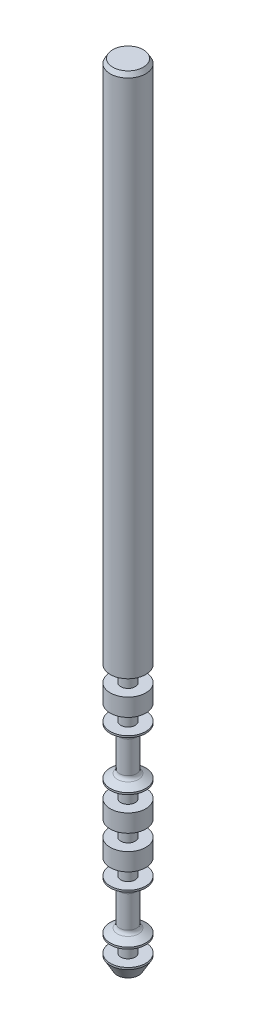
ISO-10303-21;
HEADER;
FILE_DESCRIPTION(('STEP AP214'),'2;1');
FILE_NAME('part.step','',(''),(''),'','','');
FILE_SCHEMA(('AUTOMOTIVE_DESIGN { 1 0 10303 214 1 1 1 1 }'));
ENDSEC;
DATA;
#1=APPLICATION_CONTEXT('core data for automotive mechanical design processes');
#2=APPLICATION_PROTOCOL_DEFINITION('international standard','automotive_design',2000,#1);
#3=PRODUCT_CONTEXT('',#1,'mechanical');
#4=PRODUCT('Part','Part','',(#3));
#5=PRODUCT_RELATED_PRODUCT_CATEGORY('part','',(#4));
#6=PRODUCT_DEFINITION_FORMATION('','',#4);
#7=PRODUCT_DEFINITION_CONTEXT('part definition',#1,'design');
#8=PRODUCT_DEFINITION('design','',#6,#7);
#9=PRODUCT_DEFINITION_SHAPE('','',#8);
#10=(LENGTH_UNIT() NAMED_UNIT(*) SI_UNIT(.MILLI.,.METRE.));
#11=(NAMED_UNIT(*) PLANE_ANGLE_UNIT() SI_UNIT($,.RADIAN.));
#12=(NAMED_UNIT(*) SI_UNIT($,.STERADIAN.) SOLID_ANGLE_UNIT());
#13=UNCERTAINTY_MEASURE_WITH_UNIT(LENGTH_MEASURE(1.E-05),#10,'distance_accuracy_value','');
#14=(GEOMETRIC_REPRESENTATION_CONTEXT(3) GLOBAL_UNCERTAINTY_ASSIGNED_CONTEXT((#13)) GLOBAL_UNIT_ASSIGNED_CONTEXT((#10,
#11,#12)) REPRESENTATION_CONTEXT('',''));
#15=CARTESIAN_POINT('',(0.,0.,0.));
#16=DIRECTION('',(0.,0.,1.));
#17=DIRECTION('',(1.,0.,0.));
#18=AXIS2_PLACEMENT_3D('',#15,#16,#17);
#19=CARTESIAN_POINT('',(58.02,-2.4,1.65));
#20=DIRECTION('',(0.,1.,0.));
#21=DIRECTION('',(0.,0.,1.));
#22=AXIS2_PLACEMENT_3D('',#19,#20,#21);
#23=PLANE('',#22);
#24=CARTESIAN_POINT('',(56.,-2.4,1.65));
#25=DIRECTION('',(0.,1.,0.));
#26=DIRECTION('',(0.,0.,1.));
#27=AXIS2_PLACEMENT_3D('',#24,#25,#26);
#28=CIRCLE('',#27,1.73132486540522);
#29=CARTESIAN_POINT('',(56.,-2.4,3.38132486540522));
#30=VERTEX_POINT('',#29);
#31=EDGE_CURVE('E12',#30,#30,#28,.T.);
#32=ORIENTED_EDGE('',*,*,#31,.T.);
#33=EDGE_LOOP('',(#32));
#34=FACE_BOUND('',#33,.T.);
#35=ADVANCED_FACE('F45',(#34),#23,.T.);
#36=CARTESIAN_POINT('',(56.,-1065.45754338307,1.65));
#37=DIRECTION('',(0.,-1.,0.));
#38=DIRECTION('',(0.,0.,-1.));
#39=AXIS2_PLACEMENT_3D('',#36,#37,#38);
#40=CYLINDRICAL_SURFACE('',#39,2.02);
#41=CARTESIAN_POINT('',(56.,-2.8999999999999,1.65));
#42=DIRECTION('',(0.,1.,0.));
#43=DIRECTION('',(0.,0.,1.));
#44=AXIS2_PLACEMENT_3D('',#41,#42,#43);
#45=CIRCLE('',#44,2.02);
#46=CARTESIAN_POINT('',(56.,-2.8999999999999,3.67));
#47=VERTEX_POINT('',#46);
#48=EDGE_CURVE('E52',#47,#47,#45,.F.);
#49=ORIENTED_EDGE('',*,*,#48,.T.);
#50=EDGE_LOOP('',(#49));
#51=FACE_BOUND('',#50,.T.);
#52=CARTESIAN_POINT('',(56.,-62.0000000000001,1.65));
#53=DIRECTION('',(0.,-1.,0.));
#54=DIRECTION('',(0.,0.,-1.));
#55=AXIS2_PLACEMENT_3D('',#52,#53,#54);
#56=CIRCLE('',#55,2.02000000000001);
#57=CARTESIAN_POINT('',(56.,-62.0000000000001,-0.370000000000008));
#58=VERTEX_POINT('',#57);
#59=EDGE_CURVE('E89',#58,#58,#56,.T.);
#60=ORIENTED_EDGE('',*,*,#59,.F.);
#61=EDGE_LOOP('',(#60));
#62=FACE_BOUND('',#61,.T.);
#63=ADVANCED_FACE('F192',(#51,#62),#40,.T.);
#64=CARTESIAN_POINT('',(56.82,-62.,1.65));
#65=DIRECTION('',(0.,-1.,0.));
#66=DIRECTION('',(0.,0.,-1.));
#67=AXIS2_PLACEMENT_3D('',#64,#65,#66);
#68=PLANE('',#67);
#69=ORIENTED_EDGE('',*,*,#59,.T.);
#70=EDGE_LOOP('',(#69));
#71=FACE_BOUND('',#70,.T.);
#72=CARTESIAN_POINT('',(56.,-62.0000000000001,1.65));
#73=DIRECTION('',(0.,-1.,0.));
#74=DIRECTION('',(0.,0.,-1.));
#75=AXIS2_PLACEMENT_3D('',#72,#73,#74);
#76=CIRCLE('',#75,0.820000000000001);
#77=CARTESIAN_POINT('',(56.,-62.0000000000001,0.829999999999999));
#78=VERTEX_POINT('',#77);
#79=EDGE_CURVE('E92',#78,#78,#76,.T.);
#80=ORIENTED_EDGE('',*,*,#79,.F.);
#81=EDGE_LOOP('',(#80));
#82=FACE_BOUND('',#81,.T.);
#83=ADVANCED_FACE('F198',(#71,#82),#68,.T.);
#84=CARTESIAN_POINT('',(56.,-1065.45754338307,1.65));
#85=DIRECTION('',(0.,-1.,0.));
#86=DIRECTION('',(0.,0.,-1.));
#87=AXIS2_PLACEMENT_3D('',#84,#85,#86);
#88=CYLINDRICAL_SURFACE('',#87,0.820000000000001);
#89=ORIENTED_EDGE('',*,*,#79,.T.);
#90=EDGE_LOOP('',(#89));
#91=FACE_BOUND('',#90,.T.);
#92=CARTESIAN_POINT('',(56.,-63.8000000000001,1.65));
#93=DIRECTION('',(0.,-1.,0.));
#94=DIRECTION('',(0.,0.,-1.));
#95=AXIS2_PLACEMENT_3D('',#92,#93,#94);
#96=CIRCLE('',#95,0.820000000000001);
#97=CARTESIAN_POINT('',(56.,-63.8000000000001,0.829999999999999));
#98=VERTEX_POINT('',#97);
#99=EDGE_CURVE('E95',#98,#98,#96,.T.);
#100=ORIENTED_EDGE('',*,*,#99,.F.);
#101=EDGE_LOOP('',(#100));
#102=FACE_BOUND('',#101,.T.);
#103=ADVANCED_FACE('F515',(#91,#102),#88,.T.);
#104=CARTESIAN_POINT('',(58.02,-63.8,1.65));
#105=DIRECTION('',(0.,1.,0.));
#106=DIRECTION('',(0.,0.,1.));
#107=AXIS2_PLACEMENT_3D('',#104,#105,#106);
#108=PLANE('',#107);
#109=ORIENTED_EDGE('',*,*,#99,.T.);
#110=EDGE_LOOP('',(#109));
#111=FACE_BOUND('',#110,.T.);
#112=CARTESIAN_POINT('',(56.,-63.8000000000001,1.65));
#113=DIRECTION('',(0.,-1.,0.));
#114=DIRECTION('',(0.,0.,-1.));
#115=AXIS2_PLACEMENT_3D('',#112,#113,#114);
#116=CIRCLE('',#115,2.02);
#117=CARTESIAN_POINT('',(56.,-63.8000000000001,-0.370000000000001));
#118=VERTEX_POINT('',#117);
#119=EDGE_CURVE('E98',#118,#118,#116,.T.);
#120=ORIENTED_EDGE('',*,*,#119,.F.);
#121=EDGE_LOOP('',(#120));
#122=FACE_BOUND('',#121,.T.);
#123=ADVANCED_FACE('F506',(#111,#122),#108,.T.);
#124=CARTESIAN_POINT('',(56.,-1065.45754338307,1.65));
#125=DIRECTION('',(0.,-1.,0.));
#126=DIRECTION('',(0.,0.,-1.));
#127=AXIS2_PLACEMENT_3D('',#124,#125,#126);
#128=CYLINDRICAL_SURFACE('',#127,2.02);
#129=ORIENTED_EDGE('',*,*,#119,.T.);
#130=EDGE_LOOP('',(#129));
#131=FACE_BOUND('',#130,.T.);
#132=CARTESIAN_POINT('',(56.,-65.8,1.65));
#133=DIRECTION('',(0.,-1.,0.));
#134=DIRECTION('',(0.,0.,-1.));
#135=AXIS2_PLACEMENT_3D('',#132,#133,#134);
#136=CIRCLE('',#135,2.02);
#137=CARTESIAN_POINT('',(56.,-65.8,-0.370000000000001));
#138=VERTEX_POINT('',#137);
#139=EDGE_CURVE('E101',#138,#138,#136,.T.);
#140=ORIENTED_EDGE('',*,*,#139,.F.);
#141=EDGE_LOOP('',(#140));
#142=FACE_BOUND('',#141,.T.);
#143=ADVANCED_FACE('F497',(#131,#142),#128,.T.);
#144=CARTESIAN_POINT('',(58.02,-65.8,1.65));
#145=DIRECTION('',(0.,-1.,0.));
#146=DIRECTION('',(0.,0.,-1.));
#147=AXIS2_PLACEMENT_3D('',#144,#145,#146);
#148=PLANE('',#147);
#149=ORIENTED_EDGE('',*,*,#139,.T.);
#150=EDGE_LOOP('',(#149));
#151=FACE_BOUND('',#150,.T.);
#152=CARTESIAN_POINT('',(56.,-65.8,1.65));
#153=DIRECTION('',(0.,-1.,0.));
#154=DIRECTION('',(0.,0.,-1.));
#155=AXIS2_PLACEMENT_3D('',#152,#153,#154);
#156=CIRCLE('',#155,0.820000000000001);
#157=CARTESIAN_POINT('',(56.,-65.8,0.829999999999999));
#158=VERTEX_POINT('',#157);
#159=EDGE_CURVE('E104',#158,#158,#156,.T.);
#160=ORIENTED_EDGE('',*,*,#159,.F.);
#161=EDGE_LOOP('',(#160));
#162=FACE_BOUND('',#161,.T.);
#163=ADVANCED_FACE('F488',(#151,#162),#148,.T.);
#164=CARTESIAN_POINT('',(56.,-1065.45754338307,1.65));
#165=DIRECTION('',(0.,-1.,0.));
#166=DIRECTION('',(0.,0.,-1.));
#167=AXIS2_PLACEMENT_3D('',#164,#165,#166);
#168=CYLINDRICAL_SURFACE('',#167,0.820000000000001);
#169=ORIENTED_EDGE('',*,*,#159,.T.);
#170=EDGE_LOOP('',(#169));
#171=FACE_BOUND('',#170,.T.);
#172=CARTESIAN_POINT('',(56.,-67.6,1.65));
#173=DIRECTION('',(0.,-1.,0.));
#174=DIRECTION('',(0.,0.,-1.));
#175=AXIS2_PLACEMENT_3D('',#172,#173,#174);
#176=CIRCLE('',#175,0.820000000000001);
#177=CARTESIAN_POINT('',(56.,-67.6,0.829999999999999));
#178=VERTEX_POINT('',#177);
#179=EDGE_CURVE('E107',#178,#178,#176,.T.);
#180=ORIENTED_EDGE('',*,*,#179,.F.);
#181=EDGE_LOOP('',(#180));
#182=FACE_BOUND('',#181,.T.);
#183=ADVANCED_FACE('F479',(#171,#182),#168,.T.);
#184=CARTESIAN_POINT('',(56.82,-67.6,1.65));
#185=DIRECTION('',(0.,1.,0.));
#186=DIRECTION('',(0.,0.,1.));
#187=AXIS2_PLACEMENT_3D('',#184,#185,#186);
#188=PLANE('',#187);
#189=ORIENTED_EDGE('',*,*,#179,.T.);
#190=EDGE_LOOP('',(#189));
#191=FACE_BOUND('',#190,.T.);
#192=CARTESIAN_POINT('',(56.,-67.6,1.65));
#193=DIRECTION('',(0.,-1.,0.));
#194=DIRECTION('',(0.,0.,-1.));
#195=AXIS2_PLACEMENT_3D('',#192,#193,#194);
#196=CIRCLE('',#195,2.02);
#197=CARTESIAN_POINT('',(56.,-67.6,-0.370000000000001));
#198=VERTEX_POINT('',#197);
#199=EDGE_CURVE('E110',#198,#198,#196,.T.);
#200=ORIENTED_EDGE('',*,*,#199,.F.);
#201=EDGE_LOOP('',(#200));
#202=FACE_BOUND('',#201,.T.);
#203=ADVANCED_FACE('F470',(#191,#202),#188,.T.);
#204=CARTESIAN_POINT('',(56.,-1065.45754338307,1.65));
#205=DIRECTION('',(0.,-1.,0.));
#206=DIRECTION('',(0.,0.,-1.));
#207=AXIS2_PLACEMENT_3D('',#204,#205,#206);
#208=CYLINDRICAL_SURFACE('',#207,2.02);
#209=ORIENTED_EDGE('',*,*,#199,.T.);
#210=EDGE_LOOP('',(#209));
#211=FACE_BOUND('',#210,.T.);
#212=CARTESIAN_POINT('',(56.,-67.8,1.65));
#213=DIRECTION('',(0.,-1.,0.));
#214=DIRECTION('',(0.,0.,-1.));
#215=AXIS2_PLACEMENT_3D('',#212,#213,#214);
#216=CIRCLE('',#215,2.02);
#217=CARTESIAN_POINT('',(56.,-67.8,-0.370000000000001));
#218=VERTEX_POINT('',#217);
#219=EDGE_CURVE('E113',#218,#218,#216,.T.);
#220=ORIENTED_EDGE('',*,*,#219,.F.);
#221=EDGE_LOOP('',(#220));
#222=FACE_BOUND('',#221,.T.);
#223=ADVANCED_FACE('F462',(#211,#222),#208,.T.);
#224=CARTESIAN_POINT('',(56.,-68.4177647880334,1.65));
#225=DIRECTION('',(0.,1.,0.));
#226=DIRECTION('',(0.,0.,1.));
#227=AXIS2_PLACEMENT_3D('',#224,#225,#226);
#228=CONICAL_SURFACE('',#227,0.95,1.04719755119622);
#229=CARTESIAN_POINT('',(56.,-68.273427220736,1.65));
#230=DIRECTION('',(0.,1.,0.));
#231=DIRECTION('',(0.,0.,1.));
#232=AXIS2_PLACEMENT_3D('',#229,#230,#231);
#233=CIRCLE('',#232,1.19999999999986);
#234=CARTESIAN_POINT('',(56.,-68.273427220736,2.84999999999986));
#235=VERTEX_POINT('',#234);
#236=EDGE_CURVE('E65',#235,#235,#233,.T.);
#237=ORIENTED_EDGE('',*,*,#236,.T.);
#238=EDGE_LOOP('',(#237));
#239=FACE_BOUND('',#238,.T.);
#240=ORIENTED_EDGE('',*,*,#219,.T.);
#241=EDGE_LOOP('',(#240));
#242=FACE_BOUND('',#241,.T.);
#243=ADVANCED_FACE('F454',(#239,#242),#228,.T.);
#244=CARTESIAN_POINT('',(56.,-1065.45754338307,1.65));
#245=DIRECTION('',(0.,-1.,0.));
#246=DIRECTION('',(0.,0.,-1.));
#247=AXIS2_PLACEMENT_3D('',#244,#245,#246);
#248=CYLINDRICAL_SURFACE('',#247,0.95);
#249=CARTESIAN_POINT('',(56.,-72.2935600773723,1.65));
#250=DIRECTION('',(0.,-1.,0.));
#251=DIRECTION('',(0.,0.,-1.));
#252=AXIS2_PLACEMENT_3D('',#249,#250,#251);
#253=CIRCLE('',#252,0.95);
#254=CARTESIAN_POINT('',(56.,-72.2935600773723,0.700000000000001));
#255=VERTEX_POINT('',#254);
#256=EDGE_CURVE('E68',#255,#255,#253,.F.);
#257=ORIENTED_EDGE('',*,*,#256,.T.);
#258=EDGE_LOOP('',(#257));
#259=FACE_BOUND('',#258,.T.);
#260=CARTESIAN_POINT('',(56.,-68.706439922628,1.65));
#261=DIRECTION('',(0.,-1.,0.));
#262=DIRECTION('',(0.,0.,-1.));
#263=AXIS2_PLACEMENT_3D('',#260,#261,#262);
#264=CIRCLE('',#263,0.95);
#265=CARTESIAN_POINT('',(56.,-68.706439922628,0.700000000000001));
#266=VERTEX_POINT('',#265);
#267=EDGE_CURVE('E71',#266,#266,#264,.T.);
#268=ORIENTED_EDGE('',*,*,#267,.T.);
#269=EDGE_LOOP('',(#268));
#270=FACE_BOUND('',#269,.T.);
#271=ADVANCED_FACE('F445',(#259,#270),#248,.T.);
#272=CARTESIAN_POINT('',(56.,-73.2,1.65));
#273=DIRECTION('',(0.,-1.,0.));
#274=DIRECTION('',(0.,0.,-1.));
#275=AXIS2_PLACEMENT_3D('',#272,#273,#274);
#276=CONICAL_SURFACE('',#275,2.02,1.04719755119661);
#277=CARTESIAN_POINT('',(56.,-72.7265727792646,1.65));
#278=DIRECTION('',(0.,-1.,0.));
#279=DIRECTION('',(0.,0.,-1.));
#280=AXIS2_PLACEMENT_3D('',#277,#278,#279);
#281=CIRCLE('',#280,1.19999999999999);
#282=CARTESIAN_POINT('',(56.,-72.7265727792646,0.450000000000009));
#283=VERTEX_POINT('',#282);
#284=EDGE_CURVE('E74',#283,#283,#281,.T.);
#285=ORIENTED_EDGE('',*,*,#284,.T.);
#286=EDGE_LOOP('',(#285));
#287=FACE_BOUND('',#286,.T.);
#288=CARTESIAN_POINT('',(56.,-73.2,1.65));
#289=DIRECTION('',(0.,-1.,0.));
#290=DIRECTION('',(0.,0.,-1.));
#291=AXIS2_PLACEMENT_3D('',#288,#289,#290);
#292=CIRCLE('',#291,2.02);
#293=CARTESIAN_POINT('',(56.,-73.2,-0.370000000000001));
#294=VERTEX_POINT('',#293);
#295=EDGE_CURVE('E116',#294,#294,#292,.T.);
#296=ORIENTED_EDGE('',*,*,#295,.F.);
#297=EDGE_LOOP('',(#296));
#298=FACE_BOUND('',#297,.T.);
#299=ADVANCED_FACE('F436',(#287,#298),#276,.T.);
#300=CARTESIAN_POINT('',(56.,-1065.45754338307,1.65));
#301=DIRECTION('',(0.,-1.,0.));
#302=DIRECTION('',(0.,0.,-1.));
#303=AXIS2_PLACEMENT_3D('',#300,#301,#302);
#304=CYLINDRICAL_SURFACE('',#303,2.02);
#305=ORIENTED_EDGE('',*,*,#295,.T.);
#306=EDGE_LOOP('',(#305));
#307=FACE_BOUND('',#306,.T.);
#308=CARTESIAN_POINT('',(56.,-73.4,1.65));
#309=DIRECTION('',(0.,-1.,0.));
#310=DIRECTION('',(0.,0.,-1.));
#311=AXIS2_PLACEMENT_3D('',#308,#309,#310);
#312=CIRCLE('',#311,2.02);
#313=CARTESIAN_POINT('',(56.,-73.4,-0.370000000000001));
#314=VERTEX_POINT('',#313);
#315=EDGE_CURVE('E119',#314,#314,#312,.T.);
#316=ORIENTED_EDGE('',*,*,#315,.F.);
#317=EDGE_LOOP('',(#316));
#318=FACE_BOUND('',#317,.T.);
#319=ADVANCED_FACE('F427',(#307,#318),#304,.T.);
#320=CARTESIAN_POINT('',(58.02,-73.4,1.65));
#321=DIRECTION('',(0.,-1.,0.));
#322=DIRECTION('',(0.,0.,-1.));
#323=AXIS2_PLACEMENT_3D('',#320,#321,#322);
#324=PLANE('',#323);
#325=ORIENTED_EDGE('',*,*,#315,.T.);
#326=EDGE_LOOP('',(#325));
#327=FACE_BOUND('',#326,.T.);
#328=CARTESIAN_POINT('',(56.,-73.4,1.65));
#329=DIRECTION('',(0.,-1.,0.));
#330=DIRECTION('',(0.,0.,-1.));
#331=AXIS2_PLACEMENT_3D('',#328,#329,#330);
#332=CIRCLE('',#331,0.820000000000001);
#333=CARTESIAN_POINT('',(56.,-73.4,0.829999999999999));
#334=VERTEX_POINT('',#333);
#335=EDGE_CURVE('E122',#334,#334,#332,.T.);
#336=ORIENTED_EDGE('',*,*,#335,.F.);
#337=EDGE_LOOP('',(#336));
#338=FACE_BOUND('',#337,.T.);
#339=ADVANCED_FACE('F418',(#327,#338),#324,.T.);
#340=CARTESIAN_POINT('',(56.,-1065.45754338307,1.65));
#341=DIRECTION('',(0.,-1.,0.));
#342=DIRECTION('',(0.,0.,-1.));
#343=AXIS2_PLACEMENT_3D('',#340,#341,#342);
#344=CYLINDRICAL_SURFACE('',#343,0.820000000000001);
#345=ORIENTED_EDGE('',*,*,#335,.T.);
#346=EDGE_LOOP('',(#345));
#347=FACE_BOUND('',#346,.T.);
#348=CARTESIAN_POINT('',(56.,-75.2,1.65));
#349=DIRECTION('',(0.,-1.,0.));
#350=DIRECTION('',(0.,0.,-1.));
#351=AXIS2_PLACEMENT_3D('',#348,#349,#350);
#352=CIRCLE('',#351,0.820000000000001);
#353=CARTESIAN_POINT('',(56.,-75.2,0.829999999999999));
#354=VERTEX_POINT('',#353);
#355=EDGE_CURVE('E125',#354,#354,#352,.T.);
#356=ORIENTED_EDGE('',*,*,#355,.F.);
#357=EDGE_LOOP('',(#356));
#358=FACE_BOUND('',#357,.T.);
#359=ADVANCED_FACE('F409',(#347,#358),#344,.T.);
#360=CARTESIAN_POINT('',(56.82,-75.2,1.65));
#361=DIRECTION('',(0.,1.,0.));
#362=DIRECTION('',(0.,0.,1.));
#363=AXIS2_PLACEMENT_3D('',#360,#361,#362);
#364=PLANE('',#363);
#365=ORIENTED_EDGE('',*,*,#355,.T.);
#366=EDGE_LOOP('',(#365));
#367=FACE_BOUND('',#366,.T.);
#368=CARTESIAN_POINT('',(56.,-75.2,1.65));
#369=DIRECTION('',(0.,-1.,0.));
#370=DIRECTION('',(0.,0.,-1.));
#371=AXIS2_PLACEMENT_3D('',#368,#369,#370);
#372=CIRCLE('',#371,2.02);
#373=CARTESIAN_POINT('',(56.,-75.2,-0.370000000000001));
#374=VERTEX_POINT('',#373);
#375=EDGE_CURVE('E128',#374,#374,#372,.T.);
#376=ORIENTED_EDGE('',*,*,#375,.F.);
#377=EDGE_LOOP('',(#376));
#378=FACE_BOUND('',#377,.T.);
#379=ADVANCED_FACE('F400',(#367,#378),#364,.T.);
#380=CARTESIAN_POINT('',(56.,-1065.45754338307,1.65));
#381=DIRECTION('',(0.,-1.,0.));
#382=DIRECTION('',(0.,0.,-1.));
#383=AXIS2_PLACEMENT_3D('',#380,#381,#382);
#384=CYLINDRICAL_SURFACE('',#383,2.02);
#385=ORIENTED_EDGE('',*,*,#375,.T.);
#386=EDGE_LOOP('',(#385));
#387=FACE_BOUND('',#386,.T.);
#388=CARTESIAN_POINT('',(56.,-77.2,1.65));
#389=DIRECTION('',(0.,-1.,0.));
#390=DIRECTION('',(0.,0.,-1.));
#391=AXIS2_PLACEMENT_3D('',#388,#389,#390);
#392=CIRCLE('',#391,2.02);
#393=CARTESIAN_POINT('',(56.,-77.2,-0.370000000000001));
#394=VERTEX_POINT('',#393);
#395=EDGE_CURVE('E131',#394,#394,#392,.T.);
#396=ORIENTED_EDGE('',*,*,#395,.F.);
#397=EDGE_LOOP('',(#396));
#398=FACE_BOUND('',#397,.T.);
#399=ADVANCED_FACE('F391',(#387,#398),#384,.T.);
#400=CARTESIAN_POINT('',(58.02,-77.2,1.65));
#401=DIRECTION('',(0.,-1.,0.));
#402=DIRECTION('',(0.,0.,-1.));
#403=AXIS2_PLACEMENT_3D('',#400,#401,#402);
#404=PLANE('',#403);
#405=ORIENTED_EDGE('',*,*,#395,.T.);
#406=EDGE_LOOP('',(#405));
#407=FACE_BOUND('',#406,.T.);
#408=CARTESIAN_POINT('',(56.,-77.2,1.65));
#409=DIRECTION('',(0.,-1.,0.));
#410=DIRECTION('',(0.,0.,-1.));
#411=AXIS2_PLACEMENT_3D('',#408,#409,#410);
#412=CIRCLE('',#411,0.820000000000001);
#413=CARTESIAN_POINT('',(56.,-77.2,0.829999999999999));
#414=VERTEX_POINT('',#413);
#415=EDGE_CURVE('E134',#414,#414,#412,.T.);
#416=ORIENTED_EDGE('',*,*,#415,.F.);
#417=EDGE_LOOP('',(#416));
#418=FACE_BOUND('',#417,.T.);
#419=ADVANCED_FACE('F382',(#407,#418),#404,.T.);
#420=CARTESIAN_POINT('',(56.,-1065.45754338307,1.65));
#421=DIRECTION('',(0.,-1.,0.));
#422=DIRECTION('',(0.,0.,-1.));
#423=AXIS2_PLACEMENT_3D('',#420,#421,#422);
#424=CYLINDRICAL_SURFACE('',#423,0.820000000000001);
#425=ORIENTED_EDGE('',*,*,#415,.T.);
#426=EDGE_LOOP('',(#425));
#427=FACE_BOUND('',#426,.T.);
#428=CARTESIAN_POINT('',(56.,-79.,1.65));
#429=DIRECTION('',(0.,-1.,0.));
#430=DIRECTION('',(0.,0.,-1.));
#431=AXIS2_PLACEMENT_3D('',#428,#429,#430);
#432=CIRCLE('',#431,0.820000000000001);
#433=CARTESIAN_POINT('',(56.,-79.,0.829999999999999));
#434=VERTEX_POINT('',#433);
#435=EDGE_CURVE('E137',#434,#434,#432,.T.);
#436=ORIENTED_EDGE('',*,*,#435,.F.);
#437=EDGE_LOOP('',(#436));
#438=FACE_BOUND('',#437,.T.);
#439=ADVANCED_FACE('F373',(#427,#438),#424,.T.);
#440=CARTESIAN_POINT('',(56.82,-79.,1.65));
#441=DIRECTION('',(0.,1.,0.));
#442=DIRECTION('',(0.,0.,1.));
#443=AXIS2_PLACEMENT_3D('',#440,#441,#442);
#444=PLANE('',#443);
#445=ORIENTED_EDGE('',*,*,#435,.T.);
#446=EDGE_LOOP('',(#445));
#447=FACE_BOUND('',#446,.T.);
#448=CARTESIAN_POINT('',(56.,-79.,1.65));
#449=DIRECTION('',(0.,-1.,0.));
#450=DIRECTION('',(0.,0.,-1.));
#451=AXIS2_PLACEMENT_3D('',#448,#449,#450);
#452=CIRCLE('',#451,2.02);
#453=CARTESIAN_POINT('',(56.,-79.,-0.370000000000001));
#454=VERTEX_POINT('',#453);
#455=EDGE_CURVE('E140',#454,#454,#452,.T.);
#456=ORIENTED_EDGE('',*,*,#455,.F.);
#457=EDGE_LOOP('',(#456));
#458=FACE_BOUND('',#457,.T.);
#459=ADVANCED_FACE('F364',(#447,#458),#444,.T.);
#460=CARTESIAN_POINT('',(56.,-1065.45754338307,1.65));
#461=DIRECTION('',(0.,-1.,0.));
#462=DIRECTION('',(0.,0.,-1.));
#463=AXIS2_PLACEMENT_3D('',#460,#461,#462);
#464=CYLINDRICAL_SURFACE('',#463,2.02);
#465=ORIENTED_EDGE('',*,*,#455,.T.);
#466=EDGE_LOOP('',(#465));
#467=FACE_BOUND('',#466,.T.);
#468=CARTESIAN_POINT('',(56.,-81.,1.65));
#469=DIRECTION('',(0.,-1.,0.));
#470=DIRECTION('',(0.,0.,-1.));
#471=AXIS2_PLACEMENT_3D('',#468,#469,#470);
#472=CIRCLE('',#471,2.02);
#473=CARTESIAN_POINT('',(56.,-81.,-0.370000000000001));
#474=VERTEX_POINT('',#473);
#475=EDGE_CURVE('E143',#474,#474,#472,.T.);
#476=ORIENTED_EDGE('',*,*,#475,.F.);
#477=EDGE_LOOP('',(#476));
#478=FACE_BOUND('',#477,.T.);
#479=ADVANCED_FACE('F355',(#467,#478),#464,.T.);
#480=CARTESIAN_POINT('',(58.02,-81.,1.65));
#481=DIRECTION('',(0.,-1.,0.));
#482=DIRECTION('',(0.,0.,-1.));
#483=AXIS2_PLACEMENT_3D('',#480,#481,#482);
#484=PLANE('',#483);
#485=ORIENTED_EDGE('',*,*,#475,.T.);
#486=EDGE_LOOP('',(#485));
#487=FACE_BOUND('',#486,.T.);
#488=CARTESIAN_POINT('',(56.,-81.,1.65));
#489=DIRECTION('',(0.,-1.,0.));
#490=DIRECTION('',(0.,0.,-1.));
#491=AXIS2_PLACEMENT_3D('',#488,#489,#490);
#492=CIRCLE('',#491,0.820000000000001);
#493=CARTESIAN_POINT('',(56.,-81.,0.829999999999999));
#494=VERTEX_POINT('',#493);
#495=EDGE_CURVE('E146',#494,#494,#492,.T.);
#496=ORIENTED_EDGE('',*,*,#495,.F.);
#497=EDGE_LOOP('',(#496));
#498=FACE_BOUND('',#497,.T.);
#499=ADVANCED_FACE('F346',(#487,#498),#484,.T.);
#500=CARTESIAN_POINT('',(56.,-1065.45754338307,1.65));
#501=DIRECTION('',(0.,-1.,0.));
#502=DIRECTION('',(0.,0.,-1.));
#503=AXIS2_PLACEMENT_3D('',#500,#501,#502);
#504=CYLINDRICAL_SURFACE('',#503,0.820000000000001);
#505=ORIENTED_EDGE('',*,*,#495,.T.);
#506=EDGE_LOOP('',(#505));
#507=FACE_BOUND('',#506,.T.);
#508=CARTESIAN_POINT('',(56.,-82.8,1.65));
#509=DIRECTION('',(0.,-1.,0.));
#510=DIRECTION('',(0.,0.,-1.));
#511=AXIS2_PLACEMENT_3D('',#508,#509,#510);
#512=CIRCLE('',#511,0.820000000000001);
#513=CARTESIAN_POINT('',(56.,-82.8,0.829999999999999));
#514=VERTEX_POINT('',#513);
#515=EDGE_CURVE('E149',#514,#514,#512,.T.);
#516=ORIENTED_EDGE('',*,*,#515,.F.);
#517=EDGE_LOOP('',(#516));
#518=FACE_BOUND('',#517,.T.);
#519=ADVANCED_FACE('F337',(#507,#518),#504,.T.);
#520=CARTESIAN_POINT('',(56.82,-82.8,1.65));
#521=DIRECTION('',(0.,1.,0.));
#522=DIRECTION('',(0.,0.,1.));
#523=AXIS2_PLACEMENT_3D('',#520,#521,#522);
#524=PLANE('',#523);
#525=ORIENTED_EDGE('',*,*,#515,.T.);
#526=EDGE_LOOP('',(#525));
#527=FACE_BOUND('',#526,.T.);
#528=CARTESIAN_POINT('',(56.,-82.8,1.65));
#529=DIRECTION('',(0.,-1.,0.));
#530=DIRECTION('',(0.,0.,-1.));
#531=AXIS2_PLACEMENT_3D('',#528,#529,#530);
#532=CIRCLE('',#531,2.02000000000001);
#533=CARTESIAN_POINT('',(56.,-82.8,-0.370000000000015));
#534=VERTEX_POINT('',#533);
#535=EDGE_CURVE('E152',#534,#534,#532,.T.);
#536=ORIENTED_EDGE('',*,*,#535,.F.);
#537=EDGE_LOOP('',(#536));
#538=FACE_BOUND('',#537,.T.);
#539=ADVANCED_FACE('F328',(#527,#538),#524,.T.);
#540=CARTESIAN_POINT('',(56.,-1065.45754338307,1.65));
#541=DIRECTION('',(0.,-1.,0.));
#542=DIRECTION('',(0.,0.,-1.));
#543=AXIS2_PLACEMENT_3D('',#540,#541,#542);
#544=CYLINDRICAL_SURFACE('',#543,2.02000000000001);
#545=ORIENTED_EDGE('',*,*,#535,.T.);
#546=EDGE_LOOP('',(#545));
#547=FACE_BOUND('',#546,.T.);
#548=CARTESIAN_POINT('',(56.,-83.,1.65));
#549=DIRECTION('',(0.,-1.,0.));
#550=DIRECTION('',(0.,0.,-1.));
#551=AXIS2_PLACEMENT_3D('',#548,#549,#550);
#552=CIRCLE('',#551,2.02000000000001);
#553=CARTESIAN_POINT('',(56.,-83.,-0.370000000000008));
#554=VERTEX_POINT('',#553);
#555=EDGE_CURVE('E155',#554,#554,#552,.T.);
#556=ORIENTED_EDGE('',*,*,#555,.F.);
#557=EDGE_LOOP('',(#556));
#558=FACE_BOUND('',#557,.T.);
#559=ADVANCED_FACE('F319',(#547,#558),#544,.T.);
#560=CARTESIAN_POINT('',(56.,-83.617764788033,1.65));
#561=DIRECTION('',(0.,1.,0.));
#562=DIRECTION('',(0.,0.,1.));
#563=AXIS2_PLACEMENT_3D('',#560,#561,#562);
#564=CONICAL_SURFACE('',#563,0.95,1.04719755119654);
#565=CARTESIAN_POINT('',(56.,-83.4734272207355,1.65));
#566=DIRECTION('',(0.,1.,0.));
#567=DIRECTION('',(0.,0.,1.));
#568=AXIS2_PLACEMENT_3D('',#565,#566,#567);
#569=CIRCLE('',#568,1.19999999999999);
#570=CARTESIAN_POINT('',(56.,-83.4734272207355,2.84999999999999));
#571=VERTEX_POINT('',#570);
#572=EDGE_CURVE('E77',#571,#571,#569,.T.);
#573=ORIENTED_EDGE('',*,*,#572,.T.);
#574=EDGE_LOOP('',(#573));
#575=FACE_BOUND('',#574,.T.);
#576=ORIENTED_EDGE('',*,*,#555,.T.);
#577=EDGE_LOOP('',(#576));
#578=FACE_BOUND('',#577,.T.);
#579=ADVANCED_FACE('F310',(#575,#578),#564,.T.);
#580=CARTESIAN_POINT('',(56.,-1065.45754338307,1.65));
#581=DIRECTION('',(0.,-1.,0.));
#582=DIRECTION('',(0.,0.,-1.));
#583=AXIS2_PLACEMENT_3D('',#580,#581,#582);
#584=CYLINDRICAL_SURFACE('',#583,0.95);
#585=CARTESIAN_POINT('',(56.,-87.4935600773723,1.65));
#586=DIRECTION('',(0.,-1.,0.));
#587=DIRECTION('',(0.,0.,-1.));
#588=AXIS2_PLACEMENT_3D('',#585,#586,#587);
#589=CIRCLE('',#588,0.95);
#590=CARTESIAN_POINT('',(56.,-87.4935600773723,0.700000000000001));
#591=VERTEX_POINT('',#590);
#592=EDGE_CURVE('E80',#591,#591,#589,.F.);
#593=ORIENTED_EDGE('',*,*,#592,.T.);
#594=EDGE_LOOP('',(#593));
#595=FACE_BOUND('',#594,.T.);
#596=CARTESIAN_POINT('',(56.,-83.9064399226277,1.65));
#597=DIRECTION('',(0.,-1.,0.));
#598=DIRECTION('',(0.,0.,-1.));
#599=AXIS2_PLACEMENT_3D('',#596,#597,#598);
#600=CIRCLE('',#599,0.95);
#601=CARTESIAN_POINT('',(56.,-83.9064399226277,0.700000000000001));
#602=VERTEX_POINT('',#601);
#603=EDGE_CURVE('E83',#602,#602,#600,.T.);
#604=ORIENTED_EDGE('',*,*,#603,.T.);
#605=EDGE_LOOP('',(#604));
#606=FACE_BOUND('',#605,.T.);
#607=ADVANCED_FACE('F301',(#595,#606),#584,.T.);
#608=CARTESIAN_POINT('',(56.,-88.4,1.65));
#609=DIRECTION('',(0.,-1.,0.));
#610=DIRECTION('',(0.,0.,-1.));
#611=AXIS2_PLACEMENT_3D('',#608,#609,#610);
#612=CONICAL_SURFACE('',#611,2.02,1.04719755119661);
#613=CARTESIAN_POINT('',(56.,-87.9265727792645,1.65));
#614=DIRECTION('',(0.,-1.,0.));
#615=DIRECTION('',(0.,0.,-1.));
#616=AXIS2_PLACEMENT_3D('',#613,#614,#615);
#617=CIRCLE('',#616,1.19999999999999);
#618=CARTESIAN_POINT('',(56.,-87.9265727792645,0.450000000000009));
#619=VERTEX_POINT('',#618);
#620=EDGE_CURVE('E86',#619,#619,#617,.T.);
#621=ORIENTED_EDGE('',*,*,#620,.T.);
#622=EDGE_LOOP('',(#621));
#623=FACE_BOUND('',#622,.T.);
#624=CARTESIAN_POINT('',(56.,-88.4,1.65));
#625=DIRECTION('',(0.,-1.,0.));
#626=DIRECTION('',(0.,0.,-1.));
#627=AXIS2_PLACEMENT_3D('',#624,#625,#626);
#628=CIRCLE('',#627,2.02);
#629=CARTESIAN_POINT('',(56.,-88.4,-0.370000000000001));
#630=VERTEX_POINT('',#629);
#631=EDGE_CURVE('E158',#630,#630,#628,.T.);
#632=ORIENTED_EDGE('',*,*,#631,.F.);
#633=EDGE_LOOP('',(#632));
#634=FACE_BOUND('',#633,.T.);
#635=ADVANCED_FACE('F292',(#623,#634),#612,.T.);
#636=CARTESIAN_POINT('',(56.,-1065.45754338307,1.65));
#637=DIRECTION('',(0.,-1.,0.));
#638=DIRECTION('',(0.,0.,-1.));
#639=AXIS2_PLACEMENT_3D('',#636,#637,#638);
#640=CYLINDRICAL_SURFACE('',#639,2.02);
#641=ORIENTED_EDGE('',*,*,#631,.T.);
#642=EDGE_LOOP('',(#641));
#643=FACE_BOUND('',#642,.T.);
#644=CARTESIAN_POINT('',(56.,-88.6,1.65));
#645=DIRECTION('',(0.,-1.,0.));
#646=DIRECTION('',(0.,0.,-1.));
#647=AXIS2_PLACEMENT_3D('',#644,#645,#646);
#648=CIRCLE('',#647,2.02);
#649=CARTESIAN_POINT('',(56.,-88.6,-0.370000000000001));
#650=VERTEX_POINT('',#649);
#651=EDGE_CURVE('E161',#650,#650,#648,.T.);
#652=ORIENTED_EDGE('',*,*,#651,.F.);
#653=EDGE_LOOP('',(#652));
#654=FACE_BOUND('',#653,.T.);
#655=ADVANCED_FACE('F283',(#643,#654),#640,.T.);
#656=CARTESIAN_POINT('',(58.02,-88.6,1.65));
#657=DIRECTION('',(0.,-1.,0.));
#658=DIRECTION('',(0.,0.,-1.));
#659=AXIS2_PLACEMENT_3D('',#656,#657,#658);
#660=PLANE('',#659);
#661=ORIENTED_EDGE('',*,*,#651,.T.);
#662=EDGE_LOOP('',(#661));
#663=FACE_BOUND('',#662,.T.);
#664=CARTESIAN_POINT('',(56.,-88.6,1.65));
#665=DIRECTION('',(0.,-1.,0.));
#666=DIRECTION('',(0.,0.,-1.));
#667=AXIS2_PLACEMENT_3D('',#664,#665,#666);
#668=CIRCLE('',#667,0.820000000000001);
#669=CARTESIAN_POINT('',(56.,-88.6,0.829999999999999));
#670=VERTEX_POINT('',#669);
#671=EDGE_CURVE('E164',#670,#670,#668,.T.);
#672=ORIENTED_EDGE('',*,*,#671,.F.);
#673=EDGE_LOOP('',(#672));
#674=FACE_BOUND('',#673,.T.);
#675=ADVANCED_FACE('F188',(#663,#674),#660,.T.);
#676=CARTESIAN_POINT('',(56.,-1065.45754338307,1.65));
#677=DIRECTION('',(0.,-1.,0.));
#678=DIRECTION('',(0.,0.,-1.));
#679=AXIS2_PLACEMENT_3D('',#676,#677,#678);
#680=CYLINDRICAL_SURFACE('',#679,0.820000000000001);
#681=ORIENTED_EDGE('',*,*,#671,.T.);
#682=EDGE_LOOP('',(#681));
#683=FACE_BOUND('',#682,.T.);
#684=CARTESIAN_POINT('',(56.,-90.4,1.65));
#685=DIRECTION('',(0.,-1.,0.));
#686=DIRECTION('',(0.,0.,-1.));
#687=AXIS2_PLACEMENT_3D('',#684,#685,#686);
#688=CIRCLE('',#687,0.820000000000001);
#689=CARTESIAN_POINT('',(56.,-90.4,0.829999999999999));
#690=VERTEX_POINT('',#689);
#691=EDGE_CURVE('E167',#690,#690,#688,.T.);
#692=ORIENTED_EDGE('',*,*,#691,.F.);
#693=EDGE_LOOP('',(#692));
#694=FACE_BOUND('',#693,.T.);
#695=ADVANCED_FACE('F178',(#683,#694),#680,.T.);
#696=CARTESIAN_POINT('',(56.82,-90.4,1.65));
#697=DIRECTION('',(0.,1.,0.));
#698=DIRECTION('',(0.,0.,1.));
#699=AXIS2_PLACEMENT_3D('',#696,#697,#698);
#700=PLANE('',#699);
#701=ORIENTED_EDGE('',*,*,#691,.T.);
#702=EDGE_LOOP('',(#701));
#703=FACE_BOUND('',#702,.T.);
#704=CARTESIAN_POINT('',(56.,-90.4,1.65));
#705=DIRECTION('',(0.,-1.,0.));
#706=DIRECTION('',(0.,0.,-1.));
#707=AXIS2_PLACEMENT_3D('',#704,#705,#706);
#708=CIRCLE('',#707,2.02);
#709=CARTESIAN_POINT('',(56.,-90.4,-0.370000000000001));
#710=VERTEX_POINT('',#709);
#711=EDGE_CURVE('E170',#710,#710,#708,.T.);
#712=ORIENTED_EDGE('',*,*,#711,.F.);
#713=EDGE_LOOP('',(#712));
#714=FACE_BOUND('',#713,.T.);
#715=ADVANCED_FACE('F176',(#703,#714),#700,.T.);
#716=CARTESIAN_POINT('',(56.,-1065.45754338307,1.65));
#717=DIRECTION('',(0.,-1.,0.));
#718=DIRECTION('',(0.,0.,-1.));
#719=AXIS2_PLACEMENT_3D('',#716,#717,#718);
#720=CYLINDRICAL_SURFACE('',#719,2.02);
#721=CARTESIAN_POINT('',(56.,-90.6143593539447,1.65));
#722=DIRECTION('',(0.,-1.,0.));
#723=DIRECTION('',(0.,0.,-1.));
#724=AXIS2_PLACEMENT_3D('',#721,#722,#723);
#725=CIRCLE('',#724,2.02);
#726=CARTESIAN_POINT('',(56.,-90.6143593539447,-0.370000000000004));
#727=VERTEX_POINT('',#726);
#728=EDGE_CURVE('E56',#727,#727,#725,.F.);
#729=ORIENTED_EDGE('',*,*,#728,.T.);
#730=EDGE_LOOP('',(#729));
#731=FACE_BOUND('',#730,.T.);
#732=ORIENTED_EDGE('',*,*,#711,.T.);
#733=EDGE_LOOP('',(#732));
#734=FACE_BOUND('',#733,.T.);
#735=ADVANCED_FACE('F174',(#731,#734),#720,.T.);
#736=CARTESIAN_POINT('',(58.02,-92.,1.65));
#737=DIRECTION('',(0.,-1.,0.));
#738=DIRECTION('',(0.,0.,-1.));
#739=AXIS2_PLACEMENT_3D('',#736,#737,#738);
#740=PLANE('',#739);
#741=CARTESIAN_POINT('',(56.,-92.,1.65));
#742=DIRECTION('',(0.,-1.,0.));
#743=DIRECTION('',(0.,0.,-1.));
#744=AXIS2_PLACEMENT_3D('',#741,#742,#743);
#745=CIRCLE('',#744,1.21999999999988);
#746=CARTESIAN_POINT('',(56.,-92.,0.430000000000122));
#747=VERTEX_POINT('',#746);
#748=EDGE_CURVE('E60',#747,#747,#745,.T.);
#749=ORIENTED_EDGE('',*,*,#748,.T.);
#750=EDGE_LOOP('',(#749));
#751=FACE_BOUND('',#750,.T.);
#752=ADVANCED_FACE('F185',(#751),#740,.T.);
#753=CARTESIAN_POINT('',(56.,-87.4935600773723,1.65));
#754=DIRECTION('',(0.,-1.,0.));
#755=DIRECTION('',(0.,0.,-1.));
#756=AXIS2_PLACEMENT_3D('',#753,#754,#755);
#757=TOROIDAL_SURFACE('',#756,1.45,0.5);
#758=ORIENTED_EDGE('',*,*,#592,.F.);
#759=EDGE_LOOP('',(#758));
#760=FACE_BOUND('',#759,.T.);
#761=ORIENTED_EDGE('',*,*,#620,.F.);
#762=EDGE_LOOP('',(#761));
#763=FACE_BOUND('',#762,.T.);
#764=ADVANCED_FACE('F202',(#760,#763),#757,.F.);
#765=CARTESIAN_POINT('',(56.,-83.9064399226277,1.65));
#766=DIRECTION('',(0.,-1.,0.));
#767=DIRECTION('',(0.,0.,-1.));
#768=AXIS2_PLACEMENT_3D('',#765,#766,#767);
#769=TOROIDAL_SURFACE('',#768,1.45,0.5);
#770=ORIENTED_EDGE('',*,*,#572,.F.);
#771=EDGE_LOOP('',(#770));
#772=FACE_BOUND('',#771,.T.);
#773=ORIENTED_EDGE('',*,*,#603,.F.);
#774=EDGE_LOOP('',(#773));
#775=FACE_BOUND('',#774,.T.);
#776=ADVANCED_FACE('F205',(#772,#775),#769,.F.);
#777=CARTESIAN_POINT('',(56.,-72.2935600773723,1.65));
#778=DIRECTION('',(0.,-1.,0.));
#779=DIRECTION('',(0.,0.,-1.));
#780=AXIS2_PLACEMENT_3D('',#777,#778,#779);
#781=TOROIDAL_SURFACE('',#780,1.45,0.5);
#782=ORIENTED_EDGE('',*,*,#256,.F.);
#783=EDGE_LOOP('',(#782));
#784=FACE_BOUND('',#783,.T.);
#785=ORIENTED_EDGE('',*,*,#284,.F.);
#786=EDGE_LOOP('',(#785));
#787=FACE_BOUND('',#786,.T.);
#788=ADVANCED_FACE('F209',(#784,#787),#781,.F.);
#789=CARTESIAN_POINT('',(56.,-68.706439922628,1.65));
#790=DIRECTION('',(0.,-1.,0.));
#791=DIRECTION('',(0.,0.,-1.));
#792=AXIS2_PLACEMENT_3D('',#789,#790,#791);
#793=TOROIDAL_SURFACE('',#792,1.45,0.5);
#794=ORIENTED_EDGE('',*,*,#236,.F.);
#795=EDGE_LOOP('',(#794));
#796=FACE_BOUND('',#795,.T.);
#797=ORIENTED_EDGE('',*,*,#267,.F.);
#798=EDGE_LOOP('',(#797));
#799=FACE_BOUND('',#798,.T.);
#800=ADVANCED_FACE('F213',(#796,#799),#793,.F.);
#801=CARTESIAN_POINT('',(56.,-92.,1.65));
#802=DIRECTION('',(0.,1.,0.));
#803=DIRECTION('',(0.,0.,1.));
#804=AXIS2_PLACEMENT_3D('',#801,#802,#803);
#805=CONICAL_SURFACE('',#804,1.2199999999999,0.523598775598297);
#806=ORIENTED_EDGE('',*,*,#728,.F.);
#807=EDGE_LOOP('',(#806));
#808=FACE_BOUND('',#807,.T.);
#809=ORIENTED_EDGE('',*,*,#748,.F.);
#810=EDGE_LOOP('',(#809));
#811=FACE_BOUND('',#810,.T.);
#812=ADVANCED_FACE('F216',(#808,#811),#805,.T.);
#813=CARTESIAN_POINT('',(56.,-2.8999999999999,1.65));
#814=DIRECTION('',(0.,-1.,0.));
#815=DIRECTION('',(0.,0.,-1.));
#816=AXIS2_PLACEMENT_3D('',#813,#814,#815);
#817=CONICAL_SURFACE('',#816,2.02,0.523598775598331);
#818=ORIENTED_EDGE('',*,*,#31,.F.);
#819=EDGE_LOOP('',(#818));
#820=FACE_BOUND('',#819,.T.);
#821=ORIENTED_EDGE('',*,*,#48,.F.);
#822=EDGE_LOOP('',(#821));
#823=FACE_BOUND('',#822,.T.);
#824=ADVANCED_FACE('F47',(#820,#823),#817,.T.);
#825=CLOSED_SHELL('',(#35,#63,#83,#103,#123,#143,#163,#183,#203,#223,#243,#271,#299,#319,#339,
#359,#379,#399,#419,#439,#459,#479,#499,#519,#539,#559,#579,#607,#635,#655,#675,#695,#715,#735,
#752,#764,#776,#788,#800,#812,#824));
#826=MANIFOLD_SOLID_BREP('B2',#825);
#827=ADVANCED_BREP_SHAPE_REPRESENTATION('',(#18,#826),#14);
#828=SHAPE_DEFINITION_REPRESENTATION(#9,#827);
ENDSEC;
END-ISO-10303-21;
